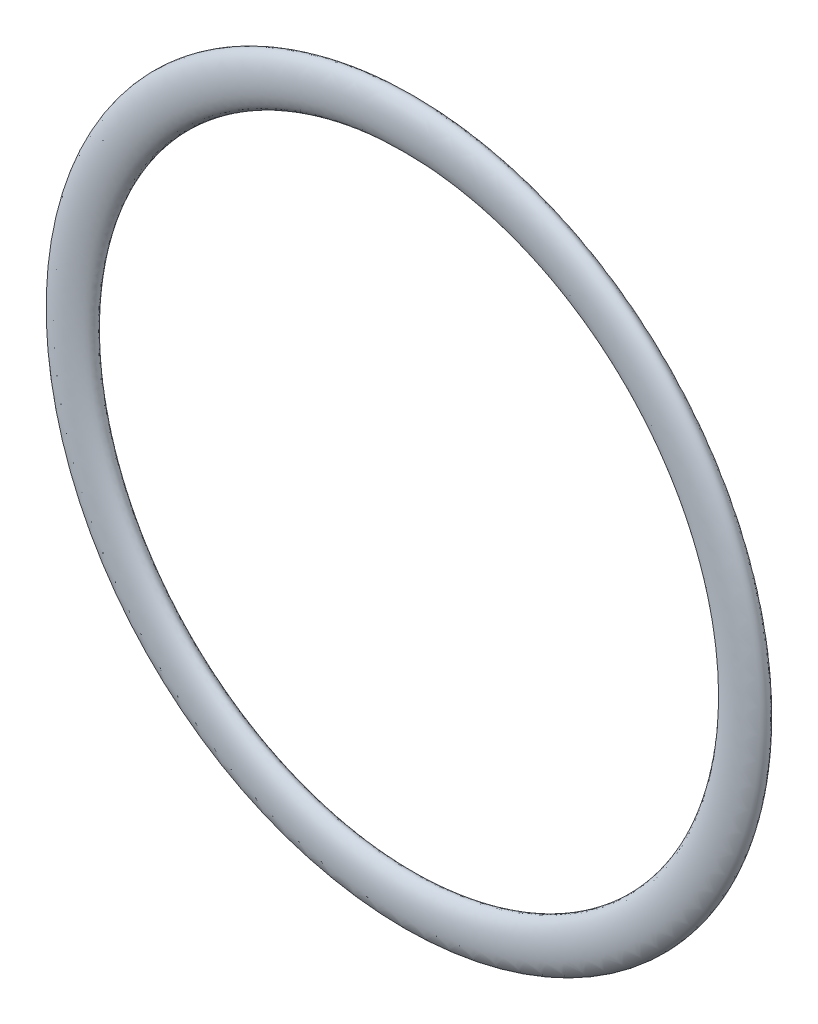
from build123d import *

# Parameters (mm, degrees)
ESQUISSE1_RX = 1.8
ESQUISSE1_RY = 0.8


with BuildPart() as part:
    # Esquisse1 → Base-R_volution (revolve)
    with BuildSketch(Plane(origin=(0, 0, 0), x_dir=(0, 0, -1), z_dir=(1, 0, 0))):
        with Locations(Location((0.8, 24.8), (0, 0, 90))):
            Ellipse(ESQUISSE1_RX, ESQUISSE1_RY)
    revolve(axis=Axis((0, 0, 0), (0, 0, -1)))


solid = part.part
